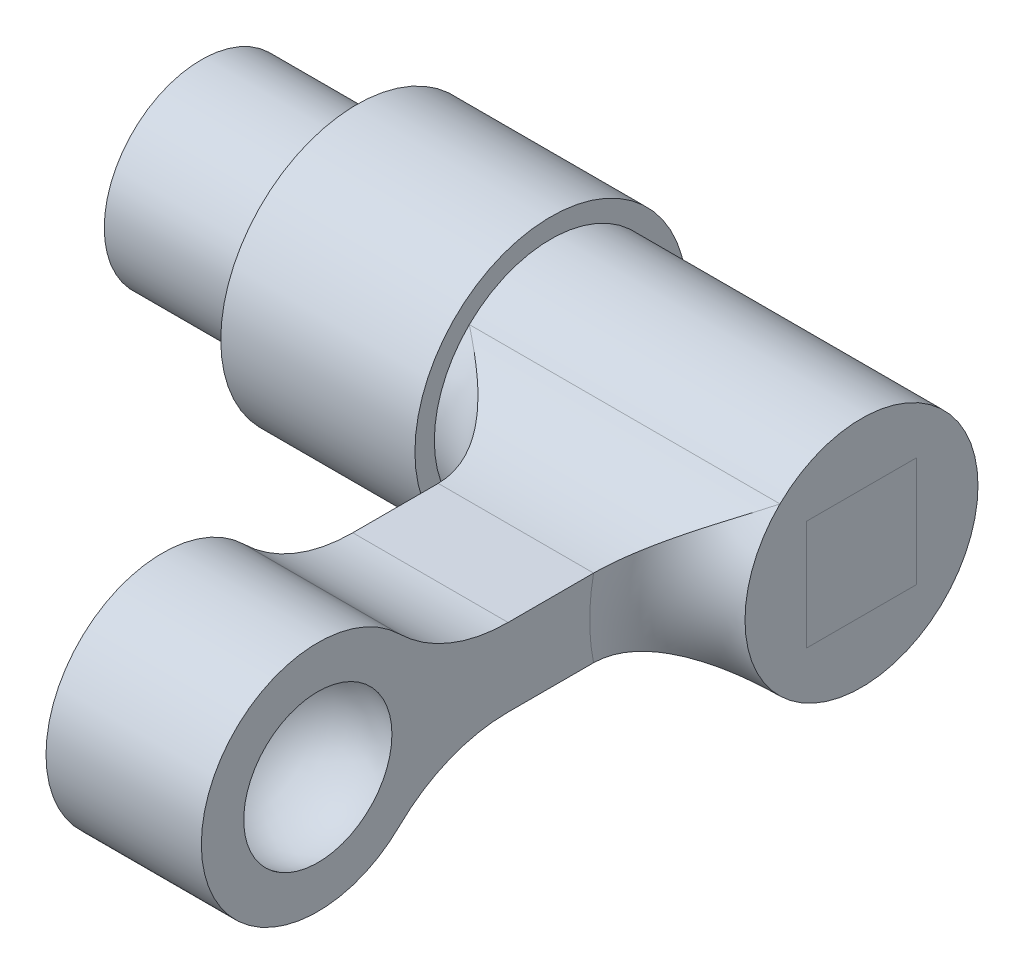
ISO-10303-21;
HEADER;
FILE_DESCRIPTION(('STEP AP214'),'2;1');
FILE_NAME('part.step','',(''),(''),'','','');
FILE_SCHEMA(('AUTOMOTIVE_DESIGN { 1 0 10303 214 1 1 1 1 }'));
ENDSEC;
DATA;
#1=APPLICATION_CONTEXT('core data for automotive mechanical design processes');
#2=APPLICATION_PROTOCOL_DEFINITION('international standard','automotive_design',2000,#1);
#3=PRODUCT_CONTEXT('',#1,'mechanical');
#4=PRODUCT('Part','Part','',(#3));
#5=PRODUCT_RELATED_PRODUCT_CATEGORY('part','',(#4));
#6=PRODUCT_DEFINITION_FORMATION('','',#4);
#7=PRODUCT_DEFINITION_CONTEXT('part definition',#1,'design');
#8=PRODUCT_DEFINITION('design','',#6,#7);
#9=PRODUCT_DEFINITION_SHAPE('','',#8);
#10=(LENGTH_UNIT() NAMED_UNIT(*) SI_UNIT(.MILLI.,.METRE.));
#11=(NAMED_UNIT(*) PLANE_ANGLE_UNIT() SI_UNIT($,.RADIAN.));
#12=(NAMED_UNIT(*) SI_UNIT($,.STERADIAN.) SOLID_ANGLE_UNIT());
#13=UNCERTAINTY_MEASURE_WITH_UNIT(LENGTH_MEASURE(1.E-05),#10,'distance_accuracy_value','');
#14=(GEOMETRIC_REPRESENTATION_CONTEXT(3) GLOBAL_UNCERTAINTY_ASSIGNED_CONTEXT((#13)) GLOBAL_UNIT_ASSIGNED_CONTEXT((#10,
#11,#12)) REPRESENTATION_CONTEXT('',''));
#15=CARTESIAN_POINT('',(0.,0.,0.));
#16=DIRECTION('',(0.,0.,1.));
#17=DIRECTION('',(1.,0.,0.));
#18=AXIS2_PLACEMENT_3D('',#15,#16,#17);
#19=CARTESIAN_POINT('',(0.,12.5,0.));
#20=DIRECTION('',(1.,0.,0.));
#21=DIRECTION('',(0.,0.,-1.));
#22=AXIS2_PLACEMENT_3D('',#19,#20,#21);
#23=PLANE('',#22);
#24=CARTESIAN_POINT('',(0.,0.,0.));
#25=DIRECTION('',(-1.,0.,0.));
#26=DIRECTION('',(0.,0.,1.));
#27=AXIS2_PLACEMENT_3D('',#24,#25,#26);
#28=CIRCLE('',#27,12.5);
#29=CARTESIAN_POINT('',(0.,0.,12.5));
#30=VERTEX_POINT('',#29);
#31=EDGE_CURVE('P0_E80',#30,#30,#28,.T.);
#32=ORIENTED_EDGE('',*,*,#31,.T.);
#33=EDGE_LOOP('',(#32));
#34=FACE_BOUND('',#33,.T.);
#35=ADVANCED_FACE('P0_F15',(#34),#23,.F.);
#36=CARTESIAN_POINT('',(45.,9.99999999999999,0.));
#37=DIRECTION('',(-1.,0.,0.));
#38=DIRECTION('',(0.,0.,1.));
#39=AXIS2_PLACEMENT_3D('',#36,#37,#38);
#40=PLANE('',#39);
#41=CARTESIAN_POINT('',(45.,0.,0.));
#42=DIRECTION('',(-1.,0.,0.));
#43=DIRECTION('',(0.,0.,1.));
#44=AXIS2_PLACEMENT_3D('',#41,#42,#43);
#45=CIRCLE('',#44,17.5);
#46=CARTESIAN_POINT('',(45.,0.,17.5));
#47=VERTEX_POINT('',#46);
#48=EDGE_CURVE('P0_E10',#47,#47,#45,.T.);
#49=ORIENTED_EDGE('',*,*,#48,.F.);
#50=EDGE_LOOP('',(#49));
#51=FACE_BOUND('',#50,.T.);
#52=DIRECTION('',(0.,-1.,0.));
#53=VECTOR('',#52,1.);
#54=CARTESIAN_POINT('',(45.,7.07106781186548,7.07106781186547));
#55=LINE('',#54,#53);
#56=CARTESIAN_POINT('',(45.,7.07106781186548,7.07106781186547));
#57=VERTEX_POINT('',#56);
#58=CARTESIAN_POINT('',(45.,-7.07106781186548,7.07106781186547));
#59=VERTEX_POINT('',#58);
#60=EDGE_CURVE('P0_E68',#57,#59,#55,.T.);
#61=ORIENTED_EDGE('',*,*,#60,.F.);
#62=DIRECTION('',(0.,0.,1.));
#63=VECTOR('',#62,1.);
#64=CARTESIAN_POINT('',(45.,7.07106781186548,-7.07106781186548));
#65=LINE('',#64,#63);
#66=CARTESIAN_POINT('',(45.,7.07106781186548,-7.07106781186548));
#67=VERTEX_POINT('',#66);
#68=EDGE_CURVE('P0_E36',#67,#57,#65,.T.);
#69=ORIENTED_EDGE('',*,*,#68,.F.);
#70=DIRECTION('',(0.,1.,0.));
#71=VECTOR('',#70,1.);
#72=CARTESIAN_POINT('',(45.,7.07106781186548,-7.07106781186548));
#73=LINE('',#72,#71);
#74=CARTESIAN_POINT('',(45.,-7.07106781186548,-7.07106781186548));
#75=VERTEX_POINT('',#74);
#76=EDGE_CURVE('P0_E65',#75,#67,#73,.T.);
#77=ORIENTED_EDGE('',*,*,#76,.F.);
#78=DIRECTION('',(0.,0.,-1.));
#79=VECTOR('',#78,1.);
#80=CARTESIAN_POINT('',(45.,-7.07106781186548,-7.07106781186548));
#81=LINE('',#80,#79);
#82=EDGE_CURVE('P0_E73',#59,#75,#81,.T.);
#83=ORIENTED_EDGE('',*,*,#82,.F.);
#84=EDGE_LOOP('',(#61,#69,#77,#83));
#85=FACE_BOUND('',#84,.T.);
#86=ADVANCED_FACE('P0_F64',(#51,#85),#40,.F.);
#87=CARTESIAN_POINT('',(0.,0.,0.));
#88=DIRECTION('',(-1.,0.,0.));
#89=DIRECTION('',(0.,0.,1.));
#90=AXIS2_PLACEMENT_3D('',#87,#88,#89);
#91=CYLINDRICAL_SURFACE('',#90,17.5);
#92=CARTESIAN_POINT('',(20.,0.,0.));
#93=DIRECTION('',(-1.,0.,0.));
#94=DIRECTION('',(0.,0.,1.));
#95=AXIS2_PLACEMENT_3D('',#92,#93,#94);
#96=CIRCLE('',#95,17.5);
#97=CARTESIAN_POINT('',(20.,0.,17.5));
#98=VERTEX_POINT('',#97);
#99=EDGE_CURVE('P0_E22',#98,#98,#96,.T.);
#100=ORIENTED_EDGE('',*,*,#99,.F.);
#101=EDGE_LOOP('',(#100));
#102=FACE_BOUND('',#101,.T.);
#103=ORIENTED_EDGE('',*,*,#48,.T.);
#104=EDGE_LOOP('',(#103));
#105=FACE_BOUND('',#104,.T.);
#106=ADVANCED_FACE('P0_F97',(#102,#105),#91,.T.);
#107=CARTESIAN_POINT('',(20.,17.5,0.));
#108=DIRECTION('',(1.,0.,0.));
#109=DIRECTION('',(0.,0.,-1.));
#110=AXIS2_PLACEMENT_3D('',#107,#108,#109);
#111=PLANE('',#110);
#112=CARTESIAN_POINT('',(20.,0.,0.));
#113=DIRECTION('',(-1.,0.,0.));
#114=DIRECTION('',(0.,0.,1.));
#115=AXIS2_PLACEMENT_3D('',#112,#113,#114);
#116=CIRCLE('',#115,12.5);
#117=CARTESIAN_POINT('',(20.,0.,12.5));
#118=VERTEX_POINT('',#117);
#119=EDGE_CURVE('P0_E90',#118,#118,#116,.T.);
#120=ORIENTED_EDGE('',*,*,#119,.F.);
#121=EDGE_LOOP('',(#120));
#122=FACE_BOUND('',#121,.T.);
#123=ORIENTED_EDGE('',*,*,#99,.T.);
#124=EDGE_LOOP('',(#123));
#125=FACE_BOUND('',#124,.T.);
#126=ADVANCED_FACE('P0_F95',(#122,#125),#111,.F.);
#127=CARTESIAN_POINT('',(0.,0.,0.));
#128=DIRECTION('',(-1.,0.,0.));
#129=DIRECTION('',(0.,0.,1.));
#130=AXIS2_PLACEMENT_3D('',#127,#128,#129);
#131=CYLINDRICAL_SURFACE('',#130,12.5);
#132=ORIENTED_EDGE('',*,*,#31,.F.);
#133=EDGE_LOOP('',(#132));
#134=FACE_BOUND('',#133,.T.);
#135=ORIENTED_EDGE('',*,*,#119,.T.);
#136=EDGE_LOOP('',(#135));
#137=FACE_BOUND('',#136,.T.);
#138=ADVANCED_FACE('P0_F135',(#134,#137),#131,.T.);
#139=CARTESIAN_POINT('',(-4.49747468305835,7.07106781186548,-7.07106781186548));
#140=DIRECTION('',(0.,0.,-1.));
#141=DIRECTION('',(-1.,0.,0.));
#142=AXIS2_PLACEMENT_3D('',#139,#140,#141);
#143=PLANE('',#142);
#144=ORIENTED_EDGE('',*,*,#76,.T.);
#145=DIRECTION('',(1.,0.,0.));
#146=VECTOR('',#145,1.);
#147=CARTESIAN_POINT('',(-4.49747468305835,7.07106781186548,-7.07106781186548));
#148=LINE('',#147,#146);
#149=CARTESIAN_POINT('',(85.,7.07106781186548,-7.07106781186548));
#150=VERTEX_POINT('',#149);
#151=EDGE_CURVE('P0_E54',#67,#150,#148,.T.);
#152=ORIENTED_EDGE('',*,*,#151,.T.);
#153=DIRECTION('',(0.,1.,0.));
#154=VECTOR('',#153,1.);
#155=CARTESIAN_POINT('',(85.,7.07106781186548,-7.07106781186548));
#156=LINE('',#155,#154);
#157=CARTESIAN_POINT('',(85.,-7.07106781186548,-7.07106781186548));
#158=VERTEX_POINT('',#157);
#159=EDGE_CURVE('P0_E77',#158,#150,#156,.T.);
#160=ORIENTED_EDGE('',*,*,#159,.F.);
#161=DIRECTION('',(1.,0.,0.));
#162=VECTOR('',#161,1.);
#163=CARTESIAN_POINT('',(-4.49747468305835,-7.07106781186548,-7.07106781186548));
#164=LINE('',#163,#162);
#165=EDGE_CURVE('P0_E71',#75,#158,#164,.T.);
#166=ORIENTED_EDGE('',*,*,#165,.F.);
#167=EDGE_LOOP('',(#144,#152,#160,#166));
#168=FACE_BOUND('',#167,.T.);
#169=ADVANCED_FACE('P0_F70',(#168),#143,.T.);
#170=CARTESIAN_POINT('',(-4.49747468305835,-7.07106781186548,-7.07106781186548));
#171=DIRECTION('',(0.,-1.,0.));
#172=DIRECTION('',(0.,0.,-1.));
#173=AXIS2_PLACEMENT_3D('',#170,#171,#172);
#174=PLANE('',#173);
#175=ORIENTED_EDGE('',*,*,#82,.T.);
#176=ORIENTED_EDGE('',*,*,#165,.T.);
#177=DIRECTION('',(0.,0.,-1.));
#178=VECTOR('',#177,1.);
#179=CARTESIAN_POINT('',(85.,-7.07106781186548,-7.07106781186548));
#180=LINE('',#179,#178);
#181=CARTESIAN_POINT('',(85.,-7.07106781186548,7.07106781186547));
#182=VERTEX_POINT('',#181);
#183=EDGE_CURVE('P0_E85',#182,#158,#180,.T.);
#184=ORIENTED_EDGE('',*,*,#183,.F.);
#185=DIRECTION('',(1.,0.,0.));
#186=VECTOR('',#185,1.);
#187=CARTESIAN_POINT('',(-4.49747468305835,-7.07106781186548,7.07106781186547));
#188=LINE('',#187,#186);
#189=EDGE_CURVE('P0_E83',#59,#182,#188,.T.);
#190=ORIENTED_EDGE('',*,*,#189,.F.);
#191=EDGE_LOOP('',(#175,#176,#184,#190));
#192=FACE_BOUND('',#191,.T.);
#193=ADVANCED_FACE('P0_F125',(#192),#174,.T.);
#194=CARTESIAN_POINT('',(-4.49747468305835,7.07106781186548,7.07106781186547));
#195=DIRECTION('',(0.,0.,1.));
#196=DIRECTION('',(1.,0.,0.));
#197=AXIS2_PLACEMENT_3D('',#194,#195,#196);
#198=PLANE('',#197);
#199=ORIENTED_EDGE('',*,*,#60,.T.);
#200=ORIENTED_EDGE('',*,*,#189,.T.);
#201=DIRECTION('',(0.,-1.,0.));
#202=VECTOR('',#201,1.);
#203=CARTESIAN_POINT('',(85.,7.07106781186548,7.07106781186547));
#204=LINE('',#203,#202);
#205=CARTESIAN_POINT('',(85.,7.07106781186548,7.07106781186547));
#206=VERTEX_POINT('',#205);
#207=EDGE_CURVE('P0_E29',#206,#182,#204,.T.);
#208=ORIENTED_EDGE('',*,*,#207,.F.);
#209=DIRECTION('',(1.,0.,0.));
#210=VECTOR('',#209,1.);
#211=CARTESIAN_POINT('',(-4.49747468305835,7.07106781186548,7.07106781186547));
#212=LINE('',#211,#210);
#213=EDGE_CURVE('P0_E86',#57,#206,#212,.T.);
#214=ORIENTED_EDGE('',*,*,#213,.F.);
#215=EDGE_LOOP('',(#199,#200,#208,#214));
#216=FACE_BOUND('',#215,.T.);
#217=ADVANCED_FACE('P0_F117',(#216),#198,.T.);
#218=CARTESIAN_POINT('',(-4.49747468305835,7.07106781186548,-7.07106781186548));
#219=DIRECTION('',(0.,1.,0.));
#220=DIRECTION('',(0.,0.,1.));
#221=AXIS2_PLACEMENT_3D('',#218,#219,#220);
#222=PLANE('',#221);
#223=ORIENTED_EDGE('',*,*,#68,.T.);
#224=ORIENTED_EDGE('',*,*,#213,.T.);
#225=DIRECTION('',(0.,0.,1.));
#226=VECTOR('',#225,1.);
#227=CARTESIAN_POINT('',(85.,7.07106781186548,-7.07106781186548));
#228=LINE('',#227,#226);
#229=EDGE_CURVE('P0_E57',#150,#206,#228,.T.);
#230=ORIENTED_EDGE('',*,*,#229,.F.);
#231=ORIENTED_EDGE('',*,*,#151,.F.);
#232=EDGE_LOOP('',(#223,#224,#230,#231));
#233=FACE_BOUND('',#232,.T.);
#234=ADVANCED_FACE('P0_F55',(#233),#222,.T.);
#235=CARTESIAN_POINT('',(85.,0.,0.));
#236=DIRECTION('',(-1.,0.,0.));
#237=DIRECTION('',(0.,0.,1.));
#238=AXIS2_PLACEMENT_3D('',#235,#236,#237);
#239=PLANE('',#238);
#240=ORIENTED_EDGE('',*,*,#159,.T.);
#241=ORIENTED_EDGE('',*,*,#229,.T.);
#242=ORIENTED_EDGE('',*,*,#207,.T.);
#243=ORIENTED_EDGE('',*,*,#183,.T.);
#244=EDGE_LOOP('',(#240,#241,#242,#243));
#245=FACE_BOUND('',#244,.T.);
#246=ADVANCED_FACE('P0_F111',(#245),#239,.F.);
#247=CLOSED_SHELL('',(#35,#86,#106,#126,#138,#169,#193,#217,#234,#246));
#248=MANIFOLD_SOLID_BREP('P0_B1',#247);
#249=CARTESIAN_POINT('',(74.9999999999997,0.,0.));
#250=DIRECTION('',(1.,0.,0.));
#251=DIRECTION('',(0.,0.,-1.));
#252=AXIS2_PLACEMENT_3D('',#249,#250,#251);
#253=PLANE('',#252);
#254=DIRECTION('',(0.,0.,-1.));
#255=VECTOR('',#254,1.);
#256=CARTESIAN_POINT('',(74.9999999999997,-5.00000000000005,14.142135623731));
#257=LINE('',#256,#255);
#258=CARTESIAN_POINT('',(74.9999999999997,-5.00000000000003,35.5051025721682));
#259=VERTEX_POINT('',#258);
#260=CARTESIAN_POINT('',(74.9999999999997,-5.00000000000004,24.4948974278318));
#261=VERTEX_POINT('',#260);
#262=EDGE_CURVE('P1_E148',#259,#261,#257,.T.);
#263=ORIENTED_EDGE('',*,*,#262,.T.);
#264=CARTESIAN_POINT('',(74.9999999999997,0.,0.));
#265=DIRECTION('',(1.,0.,0.));
#266=DIRECTION('',(0.,0.,-1.));
#267=AXIS2_PLACEMENT_3D('',#264,#265,#266);
#268=CIRCLE('',#267,25.);
#269=CARTESIAN_POINT('',(74.9999999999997,4.99999999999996,24.4948974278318));
#270=VERTEX_POINT('',#269);
#271=EDGE_CURVE('P1_E187',#261,#270,#268,.F.);
#272=ORIENTED_EDGE('',*,*,#271,.T.);
#273=DIRECTION('',(0.,0.,1.));
#274=VECTOR('',#273,1.);
#275=CARTESIAN_POINT('',(74.9999999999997,4.99999999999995,14.142135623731));
#276=LINE('',#275,#274);
#277=CARTESIAN_POINT('',(74.9999999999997,4.99999999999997,35.5051025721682));
#278=VERTEX_POINT('',#277);
#279=EDGE_CURVE('P1_E142',#270,#278,#276,.T.);
#280=ORIENTED_EDGE('',*,*,#279,.T.);
#281=CARTESIAN_POINT('',(74.9999999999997,25.,35.5051025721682));
#282=DIRECTION('',(1.,0.,0.));
#283=DIRECTION('',(0.,0.,-1.));
#284=AXIS2_PLACEMENT_3D('',#281,#282,#283);
#285=CIRCLE('',#284,20.);
#286=CARTESIAN_POINT('',(74.9999999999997,10.7142857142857,49.5021868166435));
#287=VERTEX_POINT('',#286);
#288=EDGE_CURVE('P1_E181',#278,#287,#285,.F.);
#289=ORIENTED_EDGE('',*,*,#288,.T.);
#290=CARTESIAN_POINT('',(74.9999999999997,0.,60.));
#291=DIRECTION('',(1.,0.,0.));
#292=DIRECTION('',(0.,0.,-1.));
#293=AXIS2_PLACEMENT_3D('',#290,#291,#292);
#294=CIRCLE('',#293,15.);
#295=CARTESIAN_POINT('',(74.9999999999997,-10.7142857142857,49.5021868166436));
#296=VERTEX_POINT('',#295);
#297=EDGE_CURVE('P1_E145',#287,#296,#294,.T.);
#298=ORIENTED_EDGE('',*,*,#297,.T.);
#299=CARTESIAN_POINT('',(74.9999999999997,-25.,35.5051025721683));
#300=DIRECTION('',(1.,0.,0.));
#301=DIRECTION('',(0.,0.,-1.));
#302=AXIS2_PLACEMENT_3D('',#299,#300,#301);
#303=CIRCLE('',#302,20.);
#304=EDGE_CURVE('P1_E185',#296,#259,#303,.F.);
#305=ORIENTED_EDGE('',*,*,#304,.T.);
#306=EDGE_LOOP('',(#263,#272,#280,#289,#298,#305));
#307=FACE_BOUND('',#306,.T.);
#308=CARTESIAN_POINT('',(74.9999999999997,0.,60.));
#309=DIRECTION('',(1.,0.,0.));
#310=DIRECTION('',(0.,0.,-1.));
#311=AXIS2_PLACEMENT_3D('',#308,#309,#310);
#312=CIRCLE('',#311,9.53939201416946);
#313=CARTESIAN_POINT('',(74.9999999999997,0.,50.4606079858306));
#314=VERTEX_POINT('',#313);
#315=EDGE_CURVE('P1_E19',#314,#314,#312,.F.);
#316=ORIENTED_EDGE('',*,*,#315,.T.);
#317=EDGE_LOOP('',(#316));
#318=FACE_BOUND('',#317,.T.);
#319=ADVANCED_FACE('P1_F15',(#307,#318),#253,.T.);
#320=CARTESIAN_POINT('',(84.9999999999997,0.,0.));
#321=DIRECTION('',(1.,0.,0.));
#322=DIRECTION('',(0.,0.,-1.));
#323=AXIS2_PLACEMENT_3D('',#320,#321,#322);
#324=PLANE('',#323);
#325=CARTESIAN_POINT('',(84.9999999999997,0.,0.));
#326=DIRECTION('',(1.,0.,0.));
#327=DIRECTION('',(0.,0.,-1.));
#328=AXIS2_PLACEMENT_3D('',#325,#326,#327);
#329=CIRCLE('',#328,15.);
#330=CARTESIAN_POINT('',(84.9999999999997,10.7142857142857,10.4978131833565));
#331=VERTEX_POINT('',#330);
#332=CARTESIAN_POINT('',(84.9999999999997,-10.7142857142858,10.4978131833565));
#333=VERTEX_POINT('',#332);
#334=EDGE_CURVE('P1_E156',#331,#333,#329,.T.);
#335=ORIENTED_EDGE('',*,*,#334,.T.);
#336=EDGE_CURVE('P1_E155',#333,#331,#329,.T.);
#337=ORIENTED_EDGE('',*,*,#336,.T.);
#338=EDGE_LOOP('',(#335,#337));
#339=FACE_BOUND('',#338,.T.);
#340=DIRECTION('',(0.,-1.,0.));
#341=VECTOR('',#340,1.);
#342=CARTESIAN_POINT('',(84.9999999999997,7.07106781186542,7.07106781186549));
#343=LINE('',#342,#341);
#344=CARTESIAN_POINT('',(84.9999999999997,7.07106781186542,7.07106781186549));
#345=VERTEX_POINT('',#344);
#346=CARTESIAN_POINT('',(84.9999999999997,-7.07106781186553,7.07106781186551));
#347=VERTEX_POINT('',#346);
#348=EDGE_CURVE('P1_E121',#345,#347,#343,.T.);
#349=ORIENTED_EDGE('',*,*,#348,.F.);
#350=DIRECTION('',(0.,0.,1.));
#351=VECTOR('',#350,1.);
#352=CARTESIAN_POINT('',(84.9999999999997,7.0710678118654,-7.07106781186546));
#353=LINE('',#352,#351);
#354=CARTESIAN_POINT('',(84.9999999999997,7.0710678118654,-7.07106781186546));
#355=VERTEX_POINT('',#354);
#356=EDGE_CURVE('P1_E107',#355,#345,#353,.T.);
#357=ORIENTED_EDGE('',*,*,#356,.F.);
#358=DIRECTION('',(0.,1.,0.));
#359=VECTOR('',#358,1.);
#360=CARTESIAN_POINT('',(84.9999999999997,7.0710678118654,-7.07106781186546));
#361=LINE('',#360,#359);
#362=CARTESIAN_POINT('',(84.9999999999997,-7.07106781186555,-7.07106781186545));
#363=VERTEX_POINT('',#362);
#364=EDGE_CURVE('P1_E114',#363,#355,#361,.T.);
#365=ORIENTED_EDGE('',*,*,#364,.F.);
#366=DIRECTION('',(0.,0.,-1.));
#367=VECTOR('',#366,1.);
#368=CARTESIAN_POINT('',(84.9999999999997,-7.07106781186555,-7.07106781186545));
#369=LINE('',#368,#367);
#370=EDGE_CURVE('P1_E111',#347,#363,#369,.T.);
#371=ORIENTED_EDGE('',*,*,#370,.F.);
#372=EDGE_LOOP('',(#349,#357,#365,#371));
#373=FACE_BOUND('',#372,.T.);
#374=ADVANCED_FACE('P1_F119',(#339,#373),#324,.T.);
#375=CARTESIAN_POINT('',(44.9999999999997,0.,0.));
#376=DIRECTION('',(1.,0.,0.));
#377=DIRECTION('',(0.,0.,-1.));
#378=AXIS2_PLACEMENT_3D('',#375,#376,#377);
#379=PLANE('',#378);
#380=CARTESIAN_POINT('',(44.9999999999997,0.,0.));
#381=DIRECTION('',(1.,0.,0.));
#382=DIRECTION('',(0.,0.,-1.));
#383=AXIS2_PLACEMENT_3D('',#380,#381,#382);
#384=CIRCLE('',#383,15.);
#385=CARTESIAN_POINT('',(44.9999999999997,10.7142857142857,10.4978131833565));
#386=VERTEX_POINT('',#385);
#387=CARTESIAN_POINT('',(44.9999999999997,-10.7142857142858,10.4978131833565));
#388=VERTEX_POINT('',#387);
#389=EDGE_CURVE('P1_E152',#386,#388,#384,.T.);
#390=ORIENTED_EDGE('',*,*,#389,.F.);
#391=EDGE_CURVE('P1_E151',#388,#386,#384,.T.);
#392=ORIENTED_EDGE('',*,*,#391,.F.);
#393=EDGE_LOOP('',(#390,#392));
#394=FACE_BOUND('',#393,.T.);
#395=DIRECTION('',(0.,-1.,0.));
#396=VECTOR('',#395,1.);
#397=CARTESIAN_POINT('',(44.9999999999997,7.07106781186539,-7.07106781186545));
#398=LINE('',#397,#396);
#399=CARTESIAN_POINT('',(44.9999999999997,7.07106781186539,-7.07106781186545));
#400=VERTEX_POINT('',#399);
#401=CARTESIAN_POINT('',(44.9999999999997,-7.07106781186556,-7.07106781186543));
#402=VERTEX_POINT('',#401);
#403=EDGE_CURVE('P1_E132',#400,#402,#398,.T.);
#404=ORIENTED_EDGE('',*,*,#403,.F.);
#405=DIRECTION('',(0.,0.,-1.));
#406=VECTOR('',#405,1.);
#407=CARTESIAN_POINT('',(44.9999999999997,7.07106781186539,-7.07106781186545));
#408=LINE('',#407,#406);
#409=CARTESIAN_POINT('',(44.9999999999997,7.07106781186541,7.0710678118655));
#410=VERTEX_POINT('',#409);
#411=EDGE_CURVE('P1_E31',#410,#400,#408,.T.);
#412=ORIENTED_EDGE('',*,*,#411,.F.);
#413=DIRECTION('',(0.,1.,0.));
#414=VECTOR('',#413,1.);
#415=CARTESIAN_POINT('',(44.9999999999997,7.07106781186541,7.0710678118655));
#416=LINE('',#415,#414);
#417=CARTESIAN_POINT('',(44.9999999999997,-7.07106781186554,7.07106781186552));
#418=VERTEX_POINT('',#417);
#419=EDGE_CURVE('P1_E291',#418,#410,#416,.T.);
#420=ORIENTED_EDGE('',*,*,#419,.F.);
#421=DIRECTION('',(0.,0.,1.));
#422=VECTOR('',#421,1.);
#423=CARTESIAN_POINT('',(44.9999999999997,-7.07106781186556,-7.07106781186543));
#424=LINE('',#423,#422);
#425=EDGE_CURVE('P1_E290',#402,#418,#424,.T.);
#426=ORIENTED_EDGE('',*,*,#425,.F.);
#427=EDGE_LOOP('',(#404,#412,#420,#426));
#428=FACE_BOUND('',#427,.T.);
#429=ADVANCED_FACE('P1_F259',(#394,#428),#379,.F.);
#430=CARTESIAN_POINT('',(84.9999999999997,0.,0.));
#431=DIRECTION('',(-1.,0.,0.));
#432=DIRECTION('',(0.,0.,1.));
#433=AXIS2_PLACEMENT_3D('',#430,#431,#432);
#434=CYLINDRICAL_SURFACE('',#433,15.);
#435=ORIENTED_EDGE('',*,*,#336,.F.);
#436=DIRECTION('',(-1.,0.,0.));
#437=VECTOR('',#436,1.);
#438=CARTESIAN_POINT('',(84.9999999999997,-10.7142857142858,10.4978131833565));
#439=LINE('',#438,#437);
#440=EDGE_CURVE('P1_E169',#333,#388,#439,.T.);
#441=ORIENTED_EDGE('',*,*,#440,.T.);
#442=ORIENTED_EDGE('',*,*,#391,.T.);
#443=DIRECTION('',(-1.,0.,0.));
#444=VECTOR('',#443,1.);
#445=CARTESIAN_POINT('',(84.9999999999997,10.7142857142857,10.4978131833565));
#446=LINE('',#445,#444);
#447=EDGE_CURVE('P1_E171',#386,#331,#446,.F.);
#448=ORIENTED_EDGE('',*,*,#447,.T.);
#449=EDGE_LOOP('',(#435,#441,#442,#448));
#450=FACE_BOUND('',#449,.T.);
#451=ADVANCED_FACE('P1_F17',(#450),#434,.T.);
#452=CARTESIAN_POINT('',(54.9999999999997,0.,0.));
#453=DIRECTION('',(1.,0.,0.));
#454=DIRECTION('',(0.,0.,-1.));
#455=AXIS2_PLACEMENT_3D('',#452,#453,#454);
#456=PLANE('',#455);
#457=DIRECTION('',(0.,0.,1.));
#458=VECTOR('',#457,1.);
#459=CARTESIAN_POINT('',(54.9999999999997,4.99999999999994,14.142135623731));
#460=LINE('',#459,#458);
#461=CARTESIAN_POINT('',(54.9999999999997,4.99999999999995,24.4948974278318));
#462=VERTEX_POINT('',#461);
#463=CARTESIAN_POINT('',(54.9999999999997,4.99999999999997,35.5051025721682));
#464=VERTEX_POINT('',#463);
#465=EDGE_CURVE('P1_E133',#462,#464,#460,.T.);
#466=ORIENTED_EDGE('',*,*,#465,.F.);
#467=CARTESIAN_POINT('',(54.9999999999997,0.,0.));
#468=DIRECTION('',(1.,0.,0.));
#469=DIRECTION('',(0.,0.,-1.));
#470=AXIS2_PLACEMENT_3D('',#467,#468,#469);
#471=CIRCLE('',#470,25.);
#472=CARTESIAN_POINT('',(54.9999999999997,-5.00000000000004,24.4948974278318));
#473=VERTEX_POINT('',#472);
#474=EDGE_CURVE('P1_E189',#462,#473,#471,.T.);
#475=ORIENTED_EDGE('',*,*,#474,.T.);
#476=DIRECTION('',(0.,0.,-1.));
#477=VECTOR('',#476,1.);
#478=CARTESIAN_POINT('',(54.9999999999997,-5.00000000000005,14.142135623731));
#479=LINE('',#478,#477);
#480=CARTESIAN_POINT('',(54.9999999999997,-5.00000000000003,35.5051025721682));
#481=VERTEX_POINT('',#480);
#482=EDGE_CURVE('P1_E139',#481,#473,#479,.T.);
#483=ORIENTED_EDGE('',*,*,#482,.F.);
#484=CARTESIAN_POINT('',(54.9999999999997,-25.,35.5051025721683));
#485=DIRECTION('',(1.,0.,0.));
#486=DIRECTION('',(0.,0.,-1.));
#487=AXIS2_PLACEMENT_3D('',#484,#485,#486);
#488=CIRCLE('',#487,20.);
#489=CARTESIAN_POINT('',(54.9999999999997,-10.7142857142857,49.5021868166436));
#490=VERTEX_POINT('',#489);
#491=EDGE_CURVE('P1_E183',#481,#490,#488,.T.);
#492=ORIENTED_EDGE('',*,*,#491,.T.);
#493=CARTESIAN_POINT('',(54.9999999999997,0.,60.));
#494=DIRECTION('',(1.,0.,0.));
#495=DIRECTION('',(0.,0.,-1.));
#496=AXIS2_PLACEMENT_3D('',#493,#494,#495);
#497=CIRCLE('',#496,15.);
#498=CARTESIAN_POINT('',(54.9999999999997,10.7142857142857,49.5021868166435));
#499=VERTEX_POINT('',#498);
#500=EDGE_CURVE('P1_E136',#499,#490,#497,.T.);
#501=ORIENTED_EDGE('',*,*,#500,.F.);
#502=CARTESIAN_POINT('',(54.9999999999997,25.,35.5051025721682));
#503=DIRECTION('',(1.,0.,0.));
#504=DIRECTION('',(0.,0.,-1.));
#505=AXIS2_PLACEMENT_3D('',#502,#503,#504);
#506=CIRCLE('',#505,20.);
#507=EDGE_CURVE('P1_E179',#499,#464,#506,.T.);
#508=ORIENTED_EDGE('',*,*,#507,.T.);
#509=EDGE_LOOP('',(#466,#475,#483,#492,#501,#508));
#510=FACE_BOUND('',#509,.T.);
#511=ADVANCED_FACE('P1_F264',(#510),#456,.F.);
#512=CARTESIAN_POINT('',(74.9999999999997,4.99999999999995,14.142135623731));
#513=DIRECTION('',(0.,-1.,0.));
#514=DIRECTION('',(0.,0.,-1.));
#515=AXIS2_PLACEMENT_3D('',#512,#513,#514);
#516=PLANE('',#515);
#517=ORIENTED_EDGE('',*,*,#465,.T.);
#518=DIRECTION('',(1.,0.,0.));
#519=VECTOR('',#518,1.);
#520=CARTESIAN_POINT('',(74.9999999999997,4.99999999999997,35.5051025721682));
#521=LINE('',#520,#519);
#522=EDGE_CURVE('P1_E167',#464,#278,#521,.T.);
#523=ORIENTED_EDGE('',*,*,#522,.T.);
#524=ORIENTED_EDGE('',*,*,#279,.F.);
#525=DIRECTION('',(1.,0.,0.));
#526=VECTOR('',#525,1.);
#527=CARTESIAN_POINT('',(54.9999999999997,4.99999999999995,24.4948974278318));
#528=LINE('',#527,#526);
#529=EDGE_CURVE('P1_E164',#270,#462,#528,.F.);
#530=ORIENTED_EDGE('',*,*,#529,.T.);
#531=EDGE_LOOP('',(#517,#523,#524,#530));
#532=FACE_BOUND('',#531,.T.);
#533=ADVANCED_FACE('P1_F273',(#532),#516,.F.);
#534=CARTESIAN_POINT('',(74.9999999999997,0.,60.));
#535=DIRECTION('',(-1.,0.,0.));
#536=DIRECTION('',(0.,0.,1.));
#537=AXIS2_PLACEMENT_3D('',#534,#535,#536);
#538=CYLINDRICAL_SURFACE('',#537,15.);
#539=ORIENTED_EDGE('',*,*,#297,.F.);
#540=DIRECTION('',(-1.,0.,0.));
#541=VECTOR('',#540,1.);
#542=CARTESIAN_POINT('',(74.9999999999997,10.7142857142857,49.5021868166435));
#543=LINE('',#542,#541);
#544=EDGE_CURVE('P1_E161',#287,#499,#543,.T.);
#545=ORIENTED_EDGE('',*,*,#544,.T.);
#546=ORIENTED_EDGE('',*,*,#500,.T.);
#547=DIRECTION('',(-1.,0.,0.));
#548=VECTOR('',#547,1.);
#549=CARTESIAN_POINT('',(74.9999999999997,-10.7142857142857,49.5021868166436));
#550=LINE('',#549,#548);
#551=EDGE_CURVE('P1_E159',#490,#296,#550,.F.);
#552=ORIENTED_EDGE('',*,*,#551,.T.);
#553=EDGE_LOOP('',(#539,#545,#546,#552));
#554=FACE_BOUND('',#553,.T.);
#555=ADVANCED_FACE('P1_F269',(#554),#538,.T.);
#556=CARTESIAN_POINT('',(74.9999999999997,-5.00000000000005,14.142135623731));
#557=DIRECTION('',(0.,1.,0.));
#558=DIRECTION('',(0.,0.,1.));
#559=AXIS2_PLACEMENT_3D('',#556,#557,#558);
#560=PLANE('',#559);
#561=ORIENTED_EDGE('',*,*,#482,.T.);
#562=DIRECTION('',(1.,0.,0.));
#563=VECTOR('',#562,1.);
#564=CARTESIAN_POINT('',(74.9999999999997,-5.00000000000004,24.4948974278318));
#565=LINE('',#564,#563);
#566=EDGE_CURVE('P1_E176',#473,#261,#565,.T.);
#567=ORIENTED_EDGE('',*,*,#566,.T.);
#568=ORIENTED_EDGE('',*,*,#262,.F.);
#569=DIRECTION('',(1.,0.,0.));
#570=VECTOR('',#569,1.);
#571=CARTESIAN_POINT('',(54.9999999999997,-5.00000000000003,35.5051025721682));
#572=LINE('',#571,#570);
#573=EDGE_CURVE('P1_E173',#259,#481,#572,.F.);
#574=ORIENTED_EDGE('',*,*,#573,.T.);
#575=EDGE_LOOP('',(#561,#567,#568,#574));
#576=FACE_BOUND('',#575,.T.);
#577=ADVANCED_FACE('P1_F265',(#576),#560,.F.);
#578=CARTESIAN_POINT('',(74.9999999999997,25.,35.5051025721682));
#579=DIRECTION('',(-1.,0.,0.));
#580=DIRECTION('',(0.,0.,1.));
#581=AXIS2_PLACEMENT_3D('',#578,#579,#580);
#582=CYLINDRICAL_SURFACE('',#581,20.);
#583=ORIENTED_EDGE('',*,*,#288,.F.);
#584=ORIENTED_EDGE('',*,*,#522,.F.);
#585=ORIENTED_EDGE('',*,*,#507,.F.);
#586=ORIENTED_EDGE('',*,*,#544,.F.);
#587=EDGE_LOOP('',(#583,#584,#585,#586));
#588=FACE_BOUND('',#587,.T.);
#589=ADVANCED_FACE('P1_F268',(#588),#582,.F.);
#590=CARTESIAN_POINT('',(84.9999999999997,25.,24.4948974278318));
#591=DIRECTION('',(-1.,0.,0.));
#592=DIRECTION('',(0.,0.,1.));
#593=AXIS2_PLACEMENT_3D('',#590,#591,#592);
#594=CYLINDRICAL_SURFACE('',#593,20.);
#595=ORIENTED_EDGE('',*,*,#529,.F.);
#596=CARTESIAN_POINT('',(74.9999999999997,4.99999999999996,24.4948974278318));
#597=CARTESIAN_POINT('',(74.9999980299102,4.9999975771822,24.3454514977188));
#598=CARTESIAN_POINT('',(75.0032168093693,5.00167559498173,24.1960320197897));
#599=CARTESIAN_POINT('',(75.0159648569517,5.00836549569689,23.897556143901));
#600=CARTESIAN_POINT('',(75.0254932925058,5.01337693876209,23.7484997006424));
#601=CARTESIAN_POINT('',(75.0633085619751,5.03335077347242,23.3027448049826));
#602=CARTESIAN_POINT('',(75.1008261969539,5.05325284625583,23.0069929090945));
#603=CARTESIAN_POINT('',(75.1984699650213,5.1053723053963,22.4240296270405));
#604=CARTESIAN_POINT('',(75.2583258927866,5.13744257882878,22.1367587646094));
#605=CARTESIAN_POINT('',(75.3990222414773,5.21312307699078,21.5688752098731));
#606=CARTESIAN_POINT('',(75.4798709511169,5.25673786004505,21.2882651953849));
#607=CARTESIAN_POINT('',(75.6819342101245,5.36603261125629,20.6703046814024));
#608=CARTESIAN_POINT('',(75.8081688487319,5.43448860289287,20.3350851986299));
#609=CARTESIAN_POINT('',(76.0863118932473,5.58564049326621,19.678649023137));
#610=CARTESIAN_POINT('',(76.2382386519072,5.66834657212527,19.3574425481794));
#611=CARTESIAN_POINT('',(76.5649442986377,5.84645575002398,18.7287032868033));
#612=CARTESIAN_POINT('',(76.7398214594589,5.94191348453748,18.421237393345));
#613=CARTESIAN_POINT('',(77.1085605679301,6.14345361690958,17.8217691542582));
#614=CARTESIAN_POINT('',(77.3024184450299,6.2495337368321,17.5297635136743));
#615=CARTESIAN_POINT('',(77.8322978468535,6.53992179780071,16.7831158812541));
#616=CARTESIAN_POINT('',(78.1815237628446,6.73172683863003,16.3407335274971));
#617=CARTESIAN_POINT('',(78.911742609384,7.13451924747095,15.4923766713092));
#618=CARTESIAN_POINT('',(79.2927592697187,7.3455209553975,15.0864298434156));
#619=CARTESIAN_POINT('',(80.0781740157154,7.78373194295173,14.3066561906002));
#620=CARTESIAN_POINT('',(80.4825923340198,8.0109552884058,13.9328578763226));
#621=CARTESIAN_POINT('',(81.3074384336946,8.47984808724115,13.2135457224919));
#622=CARTESIAN_POINT('',(81.7278610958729,8.72151293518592,12.8680229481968));
#623=CARTESIAN_POINT('',(82.3855584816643,9.10601719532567,12.3527124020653));
#624=CARTESIAN_POINT('',(82.6192005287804,9.24383584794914,12.1744462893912));
#625=CARTESIAN_POINT('',(83.0887438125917,9.52384907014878,11.8245003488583));
#626=CARTESIAN_POINT('',(83.324644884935,9.66604332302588,11.6528200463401));
#627=CARTESIAN_POINT('',(84.0339785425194,10.0990995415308,11.1472291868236));
#628=CARTESIAN_POINT('',(84.5096862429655,10.3968084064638,10.8222701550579));
#629=CARTESIAN_POINT('',(84.9902160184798,10.7079473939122,10.5042844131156));
#630=CARTESIAN_POINT('',(84.9951080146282,10.7111160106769,10.5010482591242));
#631=CARTESIAN_POINT('',(84.9999999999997,10.7142857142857,10.4978131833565));
#632=B_SPLINE_CURVE_WITH_KNOTS('',3,(#596,#597,#598,#599,#600,#601,#602,#603,#604,#605,#606,
#607,#608,#609,#610,#611,#612,#613,#614,#615,#616,#617,#618,#619,#620,#621,#622,#623,#624,#625,
#626,#627,#628,#629,#630,#631),.UNSPECIFIED.,.F.,.F.,(4,2,2,2,2,2,2,2,2,2,2,2,2,2,2,2,2,4),(0.,
0.448243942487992,0.896428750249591,1.79140045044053,2.67588002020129,3.56070934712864,
4.65310021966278,5.74627474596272,6.84429301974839,7.94207632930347,9.72511970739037,
11.5095061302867,13.295459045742,15.080845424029,16.0545351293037,17.0281545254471,
18.9727066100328,18.9927066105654),.UNSPECIFIED.);
#633=EDGE_CURVE('P1_E200',#270,#331,#632,.T.);
#634=ORIENTED_EDGE('',*,*,#633,.T.);
#635=ORIENTED_EDGE('',*,*,#447,.F.);
#636=CARTESIAN_POINT('',(54.9999999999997,4.99999999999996,24.4948974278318));
#637=CARTESIAN_POINT('',(55.0000019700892,4.9999975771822,24.3454514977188));
#638=CARTESIAN_POINT('',(54.9967831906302,5.00167559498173,24.1960320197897));
#639=CARTESIAN_POINT('',(54.9840351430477,5.00836549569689,23.897556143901));
#640=CARTESIAN_POINT('',(54.9745067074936,5.01337693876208,23.7484997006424));
#641=CARTESIAN_POINT('',(54.9366914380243,5.03335077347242,23.3027448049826));
#642=CARTESIAN_POINT('',(54.8991738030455,5.05325284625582,23.0069929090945));
#643=CARTESIAN_POINT('',(54.8015300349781,5.1053723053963,22.4240296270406));
#644=CARTESIAN_POINT('',(54.7416741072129,5.13744257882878,22.1367587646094));
#645=CARTESIAN_POINT('',(54.6009777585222,5.21312307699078,21.5688752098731));
#646=CARTESIAN_POINT('',(54.5201290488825,5.25673786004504,21.2882651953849));
#647=CARTESIAN_POINT('',(54.318065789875,5.36603261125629,20.6703046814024));
#648=CARTESIAN_POINT('',(54.1918311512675,5.43448860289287,20.3350851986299));
#649=CARTESIAN_POINT('',(53.9136881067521,5.58564049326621,19.678649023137));
#650=CARTESIAN_POINT('',(53.7617613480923,5.66834657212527,19.3574425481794));
#651=CARTESIAN_POINT('',(53.4350557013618,5.84645575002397,18.7287032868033));
#652=CARTESIAN_POINT('',(53.2601785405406,5.94191348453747,18.421237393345));
#653=CARTESIAN_POINT('',(52.8914394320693,6.14345361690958,17.8217691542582));
#654=CARTESIAN_POINT('',(52.6975815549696,6.2495337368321,17.5297635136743));
#655=CARTESIAN_POINT('',(52.167702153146,6.53992179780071,16.7831158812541));
#656=CARTESIAN_POINT('',(51.8184762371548,6.73172683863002,16.3407335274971));
#657=CARTESIAN_POINT('',(51.0882573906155,7.13451924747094,15.4923766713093));
#658=CARTESIAN_POINT('',(50.7072407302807,7.34552095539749,15.0864298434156));
#659=CARTESIAN_POINT('',(49.9218259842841,7.78373194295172,14.3066561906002));
#660=CARTESIAN_POINT('',(49.5174076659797,8.0109552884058,13.9328578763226));
#661=CARTESIAN_POINT('',(48.6925615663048,8.47984808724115,13.2135457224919));
#662=CARTESIAN_POINT('',(48.2721389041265,8.72151293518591,12.8680229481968));
#663=CARTESIAN_POINT('',(47.6144415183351,9.10601719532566,12.3527124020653));
#664=CARTESIAN_POINT('',(47.3807994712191,9.24383584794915,12.1744462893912));
#665=CARTESIAN_POINT('',(46.9112561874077,9.52384907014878,11.8245003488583));
#666=CARTESIAN_POINT('',(46.6753551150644,9.66604332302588,11.6528200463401));
#667=CARTESIAN_POINT('',(45.96602145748,10.0990995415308,11.1472291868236));
#668=CARTESIAN_POINT('',(45.4903137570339,10.3968084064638,10.8222701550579));
#669=CARTESIAN_POINT('',(45.0097839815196,10.7079473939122,10.5042844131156));
#670=CARTESIAN_POINT('',(45.0048919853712,10.7111160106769,10.5010482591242));
#671=CARTESIAN_POINT('',(44.9999999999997,10.7142857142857,10.4978131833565));
#672=B_SPLINE_CURVE_WITH_KNOTS('',3,(#636,#637,#638,#639,#640,#641,#642,#643,#644,#645,#646,
#647,#648,#649,#650,#651,#652,#653,#654,#655,#656,#657,#658,#659,#660,#661,#662,#663,#664,#665,
#666,#667,#668,#669,#670,#671),.UNSPECIFIED.,.F.,.F.,(4,2,2,2,2,2,2,2,2,2,2,2,2,2,2,2,2,4),(0.,
0.448243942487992,0.896428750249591,1.79140045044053,2.67588002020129,3.56070934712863,
4.65310021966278,5.74627474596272,6.84429301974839,7.94207632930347,9.72511970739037,
11.5095061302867,13.295459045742,15.080845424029,16.0545351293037,17.0281545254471,
18.9727066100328,18.9927066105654),.UNSPECIFIED.);
#673=EDGE_CURVE('P1_E10',#386,#462,#672,.F.);
#674=ORIENTED_EDGE('',*,*,#673,.T.);
#675=EDGE_LOOP('',(#595,#634,#635,#674));
#676=FACE_BOUND('',#675,.T.);
#677=ADVANCED_FACE('P1_F215',(#676),#594,.F.);
#678=CARTESIAN_POINT('',(84.9999999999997,-25.,24.4948974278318));
#679=DIRECTION('',(-1.,0.,0.));
#680=DIRECTION('',(0.,0.,1.));
#681=AXIS2_PLACEMENT_3D('',#678,#679,#680);
#682=CYLINDRICAL_SURFACE('',#681,20.);
#683=ORIENTED_EDGE('',*,*,#440,.F.);
#684=CARTESIAN_POINT('',(74.9999999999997,-5.00000000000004,24.4948974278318));
#685=CARTESIAN_POINT('',(74.9999980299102,-4.99999757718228,24.3454514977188));
#686=CARTESIAN_POINT('',(75.0032168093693,-5.00167559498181,24.1960320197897));
#687=CARTESIAN_POINT('',(75.0159648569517,-5.00836549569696,23.897556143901));
#688=CARTESIAN_POINT('',(75.0254932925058,-5.01337693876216,23.7484997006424));
#689=CARTESIAN_POINT('',(75.0633085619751,-5.0333507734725,23.3027448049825));
#690=CARTESIAN_POINT('',(75.1008261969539,-5.05325284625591,23.0069929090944));
#691=CARTESIAN_POINT('',(75.1984699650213,-5.10537230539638,22.4240296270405));
#692=CARTESIAN_POINT('',(75.2583258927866,-5.13744257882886,22.1367587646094));
#693=CARTESIAN_POINT('',(75.3990222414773,-5.21312307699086,21.5688752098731));
#694=CARTESIAN_POINT('',(75.4798709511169,-5.25673786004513,21.2882651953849));
#695=CARTESIAN_POINT('',(75.6819342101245,-5.36603261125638,20.6703046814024));
#696=CARTESIAN_POINT('',(75.8081688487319,-5.43448860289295,20.3350851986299));
#697=CARTESIAN_POINT('',(76.0863118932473,-5.58564049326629,19.6786490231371));
#698=CARTESIAN_POINT('',(76.2382386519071,-5.66834657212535,19.3574425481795));
#699=CARTESIAN_POINT('',(76.5649442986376,-5.84645575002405,18.7287032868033));
#700=CARTESIAN_POINT('',(76.7398214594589,-5.94191348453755,18.421237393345));
#701=CARTESIAN_POINT('',(77.1085605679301,-6.14345361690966,17.8217691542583));
#702=CARTESIAN_POINT('',(77.3024184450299,-6.2495337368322,17.5297635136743));
#703=CARTESIAN_POINT('',(77.8322978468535,-6.53992179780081,16.7831158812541));
#704=CARTESIAN_POINT('',(78.1815237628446,-6.73172683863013,16.3407335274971));
#705=CARTESIAN_POINT('',(78.911742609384,-7.13451924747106,15.4923766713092));
#706=CARTESIAN_POINT('',(79.2927592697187,-7.34552095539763,15.0864298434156));
#707=CARTESIAN_POINT('',(80.0781740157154,-7.78373194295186,14.3066561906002));
#708=CARTESIAN_POINT('',(80.4825923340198,-8.01095528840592,13.9328578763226));
#709=CARTESIAN_POINT('',(81.3074384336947,-8.47984808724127,13.2135457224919));
#710=CARTESIAN_POINT('',(81.7278610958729,-8.72151293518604,12.8680229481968));
#711=CARTESIAN_POINT('',(82.3855584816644,-9.10601719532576,12.3527124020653));
#712=CARTESIAN_POINT('',(82.6192005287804,-9.24383584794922,12.1744462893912));
#713=CARTESIAN_POINT('',(83.0887438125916,-9.52384907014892,11.8245003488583));
#714=CARTESIAN_POINT('',(83.3246448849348,-9.66604332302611,11.65282004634));
#715=CARTESIAN_POINT('',(84.0339785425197,-10.0990995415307,11.1472291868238));
#716=CARTESIAN_POINT('',(84.5096862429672,-10.3968084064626,10.8222701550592));
#717=CARTESIAN_POINT('',(84.9902160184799,-10.7079473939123,10.5042844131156));
#718=CARTESIAN_POINT('',(84.9951080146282,-10.711116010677,10.5010482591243));
#719=CARTESIAN_POINT('',(84.9999999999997,-10.7142857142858,10.4978131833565));
#720=B_SPLINE_CURVE_WITH_KNOTS('',3,(#684,#685,#686,#687,#688,#689,#690,#691,#692,#693,#694,
#695,#696,#697,#698,#699,#700,#701,#702,#703,#704,#705,#706,#707,#708,#709,#710,#711,#712,#713,
#714,#715,#716,#717,#718,#719),.UNSPECIFIED.,.F.,.F.,(4,2,2,2,2,2,2,2,2,2,2,2,2,2,2,2,2,4),(0.,
0.448243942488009,0.896428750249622,1.79140045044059,2.67588002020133,3.56070934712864,
4.65310021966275,5.74627474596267,6.84429301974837,7.94207632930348,9.72511970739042,
11.5095061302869,13.295459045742,15.0808454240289,16.0545351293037,17.0281545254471,
18.9727066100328,18.9927066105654),.UNSPECIFIED.);
#721=EDGE_CURVE('P1_E192',#333,#261,#720,.F.);
#722=ORIENTED_EDGE('',*,*,#721,.T.);
#723=ORIENTED_EDGE('',*,*,#566,.F.);
#724=CARTESIAN_POINT('',(54.9999999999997,-5.00000000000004,24.4948974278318));
#725=CARTESIAN_POINT('',(55.0000019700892,-4.99999757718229,24.3454514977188));
#726=CARTESIAN_POINT('',(54.9967831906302,-5.00167559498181,24.1960320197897));
#727=CARTESIAN_POINT('',(54.9840351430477,-5.00836549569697,23.897556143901));
#728=CARTESIAN_POINT('',(54.9745067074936,-5.01337693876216,23.7484997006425));
#729=CARTESIAN_POINT('',(54.9366914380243,-5.0333507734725,23.3027448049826));
#730=CARTESIAN_POINT('',(54.8991738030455,-5.0532528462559,23.0069929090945));
#731=CARTESIAN_POINT('',(54.8015300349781,-5.10537230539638,22.4240296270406));
#732=CARTESIAN_POINT('',(54.7416741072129,-5.13744257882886,22.1367587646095));
#733=CARTESIAN_POINT('',(54.6009777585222,-5.21312307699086,21.5688752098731));
#734=CARTESIAN_POINT('',(54.5201290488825,-5.25673786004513,21.2882651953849));
#735=CARTESIAN_POINT('',(54.318065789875,-5.36603261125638,20.6703046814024));
#736=CARTESIAN_POINT('',(54.1918311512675,-5.43448860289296,20.3350851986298));
#737=CARTESIAN_POINT('',(53.9136881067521,-5.58564049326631,19.678649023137));
#738=CARTESIAN_POINT('',(53.7617613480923,-5.66834657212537,19.3574425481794));
#739=CARTESIAN_POINT('',(53.4350557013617,-5.84645575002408,18.7287032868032));
#740=CARTESIAN_POINT('',(53.2601785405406,-5.94191348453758,18.421237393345));
#741=CARTESIAN_POINT('',(52.8914394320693,-6.14345361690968,17.8217691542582));
#742=CARTESIAN_POINT('',(52.6975815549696,-6.24953373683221,17.5297635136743));
#743=CARTESIAN_POINT('',(52.167702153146,-6.53992179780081,16.7831158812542));
#744=CARTESIAN_POINT('',(51.8184762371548,-6.73172683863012,16.3407335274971));
#745=CARTESIAN_POINT('',(51.0882573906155,-7.13451924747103,15.4923766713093));
#746=CARTESIAN_POINT('',(50.7072407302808,-7.34552095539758,15.0864298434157));
#747=CARTESIAN_POINT('',(49.9218259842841,-7.78373194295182,14.3066561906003));
#748=CARTESIAN_POINT('',(49.5174076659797,-8.01095528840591,13.9328578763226));
#749=CARTESIAN_POINT('',(48.6925615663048,-8.47984808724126,13.2135457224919));
#750=CARTESIAN_POINT('',(48.2721389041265,-8.72151293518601,12.8680229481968));
#751=CARTESIAN_POINT('',(47.6144415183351,-9.10601719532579,12.3527124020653));
#752=CARTESIAN_POINT('',(47.3807994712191,-9.24383584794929,12.1744462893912));
#753=CARTESIAN_POINT('',(46.9112561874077,-9.52384907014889,11.8245003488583));
#754=CARTESIAN_POINT('',(46.6753551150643,-9.66604332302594,11.6528200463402));
#755=CARTESIAN_POINT('',(45.9660214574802,-10.0990995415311,11.1472291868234));
#756=CARTESIAN_POINT('',(45.4903137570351,-10.3968084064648,10.822270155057));
#757=CARTESIAN_POINT('',(45.0097839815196,-10.7079473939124,10.5042844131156));
#758=CARTESIAN_POINT('',(45.0048919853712,-10.711116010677,10.5010482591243));
#759=CARTESIAN_POINT('',(44.9999999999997,-10.7142857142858,10.4978131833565));
#760=B_SPLINE_CURVE_WITH_KNOTS('',3,(#724,#725,#726,#727,#728,#729,#730,#731,#732,#733,#734,
#735,#736,#737,#738,#739,#740,#741,#742,#743,#744,#745,#746,#747,#748,#749,#750,#751,#752,#753,
#754,#755,#756,#757,#758,#759),.UNSPECIFIED.,.F.,.F.,(4,2,2,2,2,2,2,2,2,2,2,2,2,2,2,2,2,4),(0.,
0.448243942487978,0.896428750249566,1.79140045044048,2.67588002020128,3.56070934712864,
4.65310021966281,5.74627474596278,6.84429301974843,7.94207632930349,9.72511970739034,
11.5095061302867,13.295459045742,15.080845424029,16.0545351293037,17.0281545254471,
18.9727066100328,18.9927066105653),.UNSPECIFIED.);
#761=EDGE_CURVE('P1_E24',#473,#388,#760,.T.);
#762=ORIENTED_EDGE('',*,*,#761,.T.);
#763=EDGE_LOOP('',(#683,#722,#723,#762));
#764=FACE_BOUND('',#763,.T.);
#765=ADVANCED_FACE('P1_F211',(#764),#682,.F.);
#766=CARTESIAN_POINT('',(74.9999999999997,-25.,35.5051025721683));
#767=DIRECTION('',(-1.,0.,0.));
#768=DIRECTION('',(0.,0.,1.));
#769=AXIS2_PLACEMENT_3D('',#766,#767,#768);
#770=CYLINDRICAL_SURFACE('',#769,20.);
#771=ORIENTED_EDGE('',*,*,#304,.F.);
#772=ORIENTED_EDGE('',*,*,#551,.F.);
#773=ORIENTED_EDGE('',*,*,#491,.F.);
#774=ORIENTED_EDGE('',*,*,#573,.F.);
#775=EDGE_LOOP('',(#771,#772,#773,#774));
#776=FACE_BOUND('',#775,.T.);
#777=ADVANCED_FACE('P1_F214',(#776),#770,.F.);
#778=CARTESIAN_POINT('',(84.9999999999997,0.,0.));
#779=DIRECTION('',(1.,0.,0.));
#780=DIRECTION('',(0.,0.,-1.));
#781=AXIS2_PLACEMENT_3D('',#778,#779,#780);
#782=TOROIDAL_SURFACE('',#781,25.,10.);
#783=ORIENTED_EDGE('',*,*,#633,.F.);
#784=ORIENTED_EDGE('',*,*,#271,.F.);
#785=ORIENTED_EDGE('',*,*,#721,.F.);
#786=ORIENTED_EDGE('',*,*,#334,.F.);
#787=EDGE_LOOP('',(#783,#784,#785,#786));
#788=FACE_BOUND('',#787,.T.);
#789=ADVANCED_FACE('P1_F207',(#788),#782,.F.);
#790=CARTESIAN_POINT('',(44.9999999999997,0.,0.));
#791=DIRECTION('',(1.,0.,0.));
#792=DIRECTION('',(0.,0.,-1.));
#793=AXIS2_PLACEMENT_3D('',#790,#791,#792);
#794=TOROIDAL_SURFACE('',#793,25.,10.);
#795=ORIENTED_EDGE('',*,*,#673,.F.);
#796=ORIENTED_EDGE('',*,*,#389,.T.);
#797=ORIENTED_EDGE('',*,*,#761,.F.);
#798=ORIENTED_EDGE('',*,*,#474,.F.);
#799=EDGE_LOOP('',(#795,#796,#797,#798));
#800=FACE_BOUND('',#799,.T.);
#801=ADVANCED_FACE('P1_F229',(#800),#794,.F.);
#802=CARTESIAN_POINT('',(71.9999999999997,0.,60.));
#803=DIRECTION('',(-1.,0.,0.));
#804=DIRECTION('',(0.,0.,-1.));
#805=AXIS2_PLACEMENT_3D('',#802,#803,#804);
#806=SPHERICAL_SURFACE('',#805,10.);
#807=ORIENTED_EDGE('',*,*,#315,.F.);
#808=EDGE_LOOP('',(#807));
#809=FACE_BOUND('',#808,.T.);
#810=ADVANCED_FACE('P1_F233',(#809),#806,.F.);
#811=CARTESIAN_POINT('',(15.183540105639,7.07106781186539,-7.07106781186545));
#812=DIRECTION('',(0.,1.,0.));
#813=DIRECTION('',(1.,0.,0.));
#814=AXIS2_PLACEMENT_3D('',#811,#812,#813);
#815=PLANE('',#814);
#816=DIRECTION('',(1.,0.,0.));
#817=VECTOR('',#816,1.);
#818=CARTESIAN_POINT('',(15.183540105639,7.07106781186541,7.07106781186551));
#819=LINE('',#818,#817);
#820=EDGE_CURVE('P1_E110',#410,#345,#819,.T.);
#821=ORIENTED_EDGE('',*,*,#820,.F.);
#822=ORIENTED_EDGE('',*,*,#411,.T.);
#823=DIRECTION('',(1.,0.,0.));
#824=VECTOR('',#823,1.);
#825=CARTESIAN_POINT('',(15.183540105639,7.07106781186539,-7.07106781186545));
#826=LINE('',#825,#824);
#827=EDGE_CURVE('P1_E104',#400,#355,#826,.T.);
#828=ORIENTED_EDGE('',*,*,#827,.T.);
#829=ORIENTED_EDGE('',*,*,#356,.T.);
#830=EDGE_LOOP('',(#821,#822,#828,#829));
#831=FACE_BOUND('',#830,.T.);
#832=ADVANCED_FACE('P1_F105',(#831),#815,.F.);
#833=CARTESIAN_POINT('',(15.183540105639,7.07106781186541,7.07106781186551));
#834=DIRECTION('',(0.,0.,1.));
#835=DIRECTION('',(1.,0.,0.));
#836=AXIS2_PLACEMENT_3D('',#833,#834,#835);
#837=PLANE('',#836);
#838=DIRECTION('',(1.,0.,0.));
#839=VECTOR('',#838,1.);
#840=CARTESIAN_POINT('',(15.183540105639,-7.07106781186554,7.07106781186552));
#841=LINE('',#840,#839);
#842=EDGE_CURVE('P1_E128',#418,#347,#841,.T.);
#843=ORIENTED_EDGE('',*,*,#842,.F.);
#844=ORIENTED_EDGE('',*,*,#419,.T.);
#845=ORIENTED_EDGE('',*,*,#820,.T.);
#846=ORIENTED_EDGE('',*,*,#348,.T.);
#847=EDGE_LOOP('',(#843,#844,#845,#846));
#848=FACE_BOUND('',#847,.T.);
#849=ADVANCED_FACE('P1_F244',(#848),#837,.F.);
#850=CARTESIAN_POINT('',(15.183540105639,-7.07106781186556,-7.07106781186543));
#851=DIRECTION('',(0.,-1.,0.));
#852=DIRECTION('',(-1.,0.,0.));
#853=AXIS2_PLACEMENT_3D('',#850,#851,#852);
#854=PLANE('',#853);
#855=DIRECTION('',(1.,0.,0.));
#856=VECTOR('',#855,1.);
#857=CARTESIAN_POINT('',(15.183540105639,-7.07106781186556,-7.07106781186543));
#858=LINE('',#857,#856);
#859=EDGE_CURVE('P1_E39',#402,#363,#858,.T.);
#860=ORIENTED_EDGE('',*,*,#859,.F.);
#861=ORIENTED_EDGE('',*,*,#425,.T.);
#862=ORIENTED_EDGE('',*,*,#842,.T.);
#863=ORIENTED_EDGE('',*,*,#370,.T.);
#864=EDGE_LOOP('',(#860,#861,#862,#863));
#865=FACE_BOUND('',#864,.T.);
#866=ADVANCED_FACE('P1_F241',(#865),#854,.F.);
#867=CARTESIAN_POINT('',(15.183540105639,7.07106781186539,-7.07106781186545));
#868=DIRECTION('',(0.,0.,-1.));
#869=DIRECTION('',(-1.,0.,0.));
#870=AXIS2_PLACEMENT_3D('',#867,#868,#869);
#871=PLANE('',#870);
#872=ORIENTED_EDGE('',*,*,#827,.F.);
#873=ORIENTED_EDGE('',*,*,#403,.T.);
#874=ORIENTED_EDGE('',*,*,#859,.T.);
#875=ORIENTED_EDGE('',*,*,#364,.T.);
#876=EDGE_LOOP('',(#872,#873,#874,#875));
#877=FACE_BOUND('',#876,.T.);
#878=ADVANCED_FACE('P1_F115',(#877),#871,.F.);
#879=CLOSED_SHELL('',(#319,#374,#429,#451,#511,#533,#555,#577,#589,#677,#765,#777,#789,#801,
#810,#832,#849,#866,#878));
#880=MANIFOLD_SOLID_BREP('P1_B1',#879);
#881=ADVANCED_BREP_SHAPE_REPRESENTATION('',(#18,#248,#880),#14);
#882=SHAPE_DEFINITION_REPRESENTATION(#9,#881);
ENDSEC;
END-ISO-10303-21;
